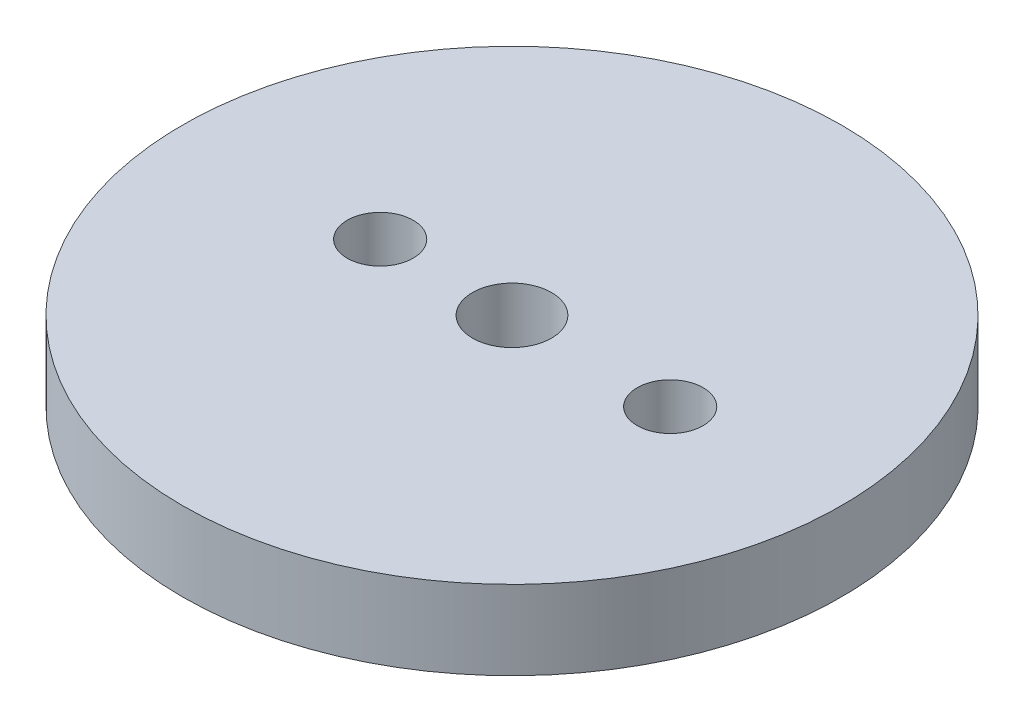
from build123d import *

# Parameters (mm, degrees)
SKETCH1_R         = 25
SKETCH1_R_2       = 3
EXTRUDE1_DEPTH    = 6
M6_TAPPED_HOLE1_D = 5


with BuildPart() as part:
    # Sketch1 → Extrude1 (new body)
    with BuildSketch(Plane(origin=(0, 0, 0), x_dir=(1, 0, 0), z_dir=(0, 1, 0))):
        with Locations(Location((0, 0, 0), (0, 0, 270))):
            Circle(SKETCH1_R)
        with Locations(Location((0, 0, 0), (0, 0, 270))):
            Circle(SKETCH1_R_2, mode=Mode.SUBTRACT)
    extrude(amount=EXTRUDE1_DEPTH)

    # M6 Tapped Hole1 (through all)
    with Locations(Plane(origin=(-10, 6, 0), x_dir=(0, 0, 1), z_dir=(0, 1, 0))):
        with Locations((0, 0), (0, 22)):
            Hole(M6_TAPPED_HOLE1_D / 2)


solid = part.part
